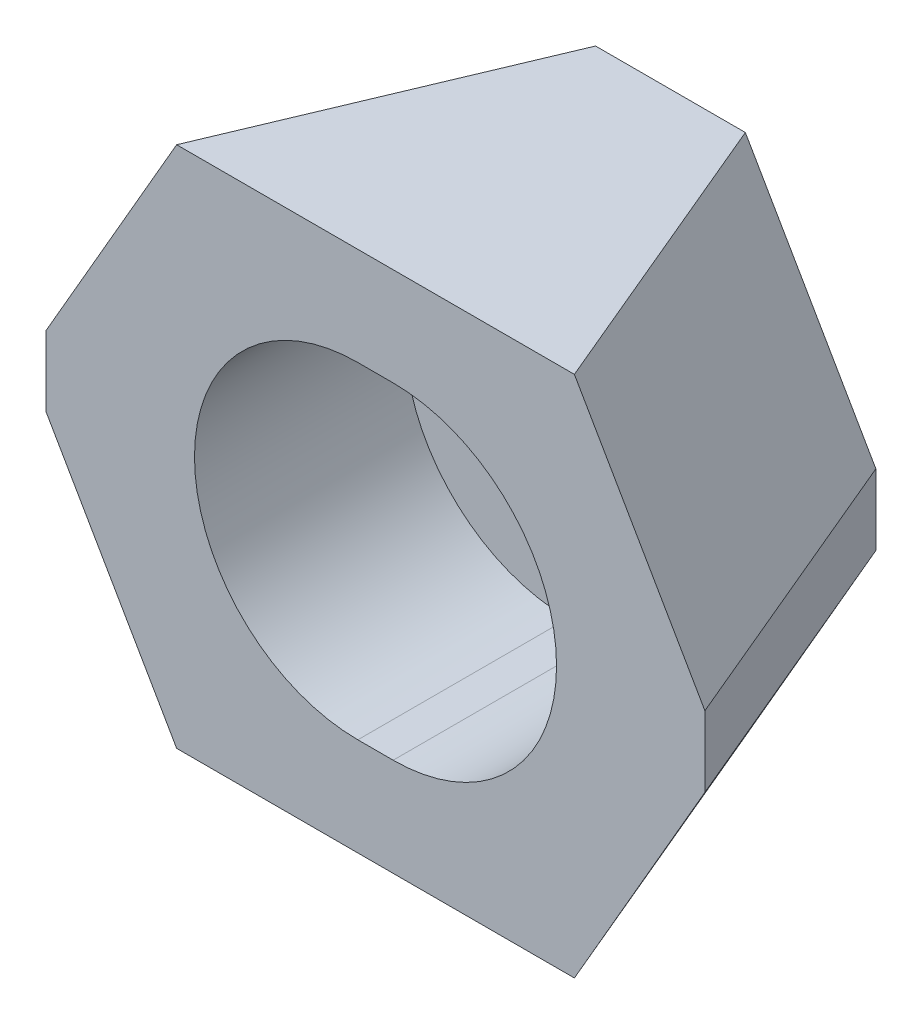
ISO-10303-21;
HEADER;
FILE_DESCRIPTION(('STEP AP214'),'2;1');
FILE_NAME('part.step','',(''),(''),'','','');
FILE_SCHEMA(('AUTOMOTIVE_DESIGN { 1 0 10303 214 1 1 1 1 }'));
ENDSEC;
DATA;
#1=APPLICATION_CONTEXT('core data for automotive mechanical design processes');
#2=APPLICATION_PROTOCOL_DEFINITION('international standard','automotive_design',2000,#1);
#3=PRODUCT_CONTEXT('',#1,'mechanical');
#4=PRODUCT('Part','Part','',(#3));
#5=PRODUCT_RELATED_PRODUCT_CATEGORY('part','',(#4));
#6=PRODUCT_DEFINITION_FORMATION('','',#4);
#7=PRODUCT_DEFINITION_CONTEXT('part definition',#1,'design');
#8=PRODUCT_DEFINITION('design','',#6,#7);
#9=PRODUCT_DEFINITION_SHAPE('','',#8);
#10=(LENGTH_UNIT() NAMED_UNIT(*) SI_UNIT(.MILLI.,.METRE.));
#11=(NAMED_UNIT(*) PLANE_ANGLE_UNIT() SI_UNIT($,.RADIAN.));
#12=(NAMED_UNIT(*) SI_UNIT($,.STERADIAN.) SOLID_ANGLE_UNIT());
#13=UNCERTAINTY_MEASURE_WITH_UNIT(LENGTH_MEASURE(1.E-05),#10,'distance_accuracy_value','');
#14=(GEOMETRIC_REPRESENTATION_CONTEXT(3) GLOBAL_UNCERTAINTY_ASSIGNED_CONTEXT((#13)) GLOBAL_UNIT_ASSIGNED_CONTEXT((#10,
#11,#12)) REPRESENTATION_CONTEXT('',''));
#15=CARTESIAN_POINT('',(0.,0.,0.));
#16=DIRECTION('',(0.,0.,1.));
#17=DIRECTION('',(1.,0.,0.));
#18=AXIS2_PLACEMENT_3D('',#15,#16,#17);
#19=CARTESIAN_POINT('',(1.,0.,16.7));
#20=DIRECTION('',(0.,0.,-1.));
#21=DIRECTION('',(-1.,0.,0.));
#22=AXIS2_PLACEMENT_3D('',#19,#20,#21);
#23=CYLINDRICAL_SURFACE('',#22,6.15);
#24=DIRECTION('',(0.,0.,1.));
#25=VECTOR('',#24,1.);
#26=CARTESIAN_POINT('',(1.,6.15,16.7));
#27=LINE('',#26,#25);
#28=CARTESIAN_POINT('',(1.,6.15,4.8));
#29=VERTEX_POINT('',#28);
#30=CARTESIAN_POINT('',(1.,6.15,0.));
#31=VERTEX_POINT('',#30);
#32=EDGE_CURVE('E215',#29,#31,#27,.F.);
#33=ORIENTED_EDGE('',*,*,#32,.T.);
#34=CARTESIAN_POINT('',(1.,0.,0.));
#35=DIRECTION('',(0.,0.,-1.));
#36=DIRECTION('',(-1.,0.,0.));
#37=AXIS2_PLACEMENT_3D('',#34,#35,#36);
#38=CIRCLE('',#37,6.15);
#39=CARTESIAN_POINT('',(1.,-6.15,0.));
#40=VERTEX_POINT('',#39);
#41=EDGE_CURVE('E139',#31,#40,#38,.T.);
#42=ORIENTED_EDGE('',*,*,#41,.T.);
#43=DIRECTION('',(0.,0.,-1.));
#44=VECTOR('',#43,1.);
#45=CARTESIAN_POINT('',(1.,-6.15,16.7));
#46=LINE('',#45,#44);
#47=CARTESIAN_POINT('',(1.,-6.15,4.8));
#48=VERTEX_POINT('',#47);
#49=EDGE_CURVE('E219',#40,#48,#46,.F.);
#50=ORIENTED_EDGE('',*,*,#49,.T.);
#51=CARTESIAN_POINT('',(1.,0.,4.8));
#52=DIRECTION('',(0.,0.,-1.));
#53=DIRECTION('',(-1.,0.,0.));
#54=AXIS2_PLACEMENT_3D('',#51,#52,#53);
#55=CIRCLE('',#54,6.15);
#56=EDGE_CURVE('E142',#29,#48,#55,.T.);
#57=ORIENTED_EDGE('',*,*,#56,.F.);
#58=EDGE_LOOP('',(#33,#42,#50,#57));
#59=FACE_BOUND('',#58,.T.);
#60=ADVANCED_FACE('F14',(#59),#23,.F.);
#61=CARTESIAN_POINT('',(-1.,-6.15,16.7));
#62=DIRECTION('',(0.,-1.,0.));
#63=DIRECTION('',(0.,0.,-1.));
#64=AXIS2_PLACEMENT_3D('',#61,#62,#63);
#65=PLANE('',#64);
#66=ORIENTED_EDGE('',*,*,#49,.F.);
#67=DIRECTION('',(1.,0.,0.));
#68=VECTOR('',#67,1.);
#69=CARTESIAN_POINT('',(0.,-6.15,0.));
#70=LINE('',#69,#68);
#71=CARTESIAN_POINT('',(-1.,-6.15,0.));
#72=VERTEX_POINT('',#71);
#73=EDGE_CURVE('E138',#40,#72,#70,.F.);
#74=ORIENTED_EDGE('',*,*,#73,.T.);
#75=DIRECTION('',(0.,0.,-1.));
#76=VECTOR('',#75,1.);
#77=CARTESIAN_POINT('',(-1.,-6.15,16.7));
#78=LINE('',#77,#76);
#79=CARTESIAN_POINT('',(-1.,-6.15,4.8));
#80=VERTEX_POINT('',#79);
#81=EDGE_CURVE('E217',#72,#80,#78,.F.);
#82=ORIENTED_EDGE('',*,*,#81,.T.);
#83=DIRECTION('',(1.,0.,0.));
#84=VECTOR('',#83,1.);
#85=CARTESIAN_POINT('',(0.,-6.15,4.8));
#86=LINE('',#85,#84);
#87=EDGE_CURVE('E141',#48,#80,#86,.F.);
#88=ORIENTED_EDGE('',*,*,#87,.F.);
#89=EDGE_LOOP('',(#66,#74,#82,#88));
#90=FACE_BOUND('',#89,.T.);
#91=ADVANCED_FACE('F455',(#90),#65,.F.);
#92=CARTESIAN_POINT('',(-1.,0.,16.7));
#93=DIRECTION('',(0.,0.,-1.));
#94=DIRECTION('',(-1.,0.,0.));
#95=AXIS2_PLACEMENT_3D('',#92,#93,#94);
#96=CYLINDRICAL_SURFACE('',#95,6.15);
#97=ORIENTED_EDGE('',*,*,#81,.F.);
#98=CARTESIAN_POINT('',(-1.,0.,0.));
#99=DIRECTION('',(0.,0.,-1.));
#100=DIRECTION('',(-1.,0.,0.));
#101=AXIS2_PLACEMENT_3D('',#98,#99,#100);
#102=CIRCLE('',#101,6.15);
#103=CARTESIAN_POINT('',(-1.,6.15,0.));
#104=VERTEX_POINT('',#103);
#105=EDGE_CURVE('E135',#72,#104,#102,.T.);
#106=ORIENTED_EDGE('',*,*,#105,.T.);
#107=DIRECTION('',(0.,0.,1.));
#108=VECTOR('',#107,1.);
#109=CARTESIAN_POINT('',(-1.,6.15,16.7));
#110=LINE('',#109,#108);
#111=CARTESIAN_POINT('',(-1.,6.15,4.8));
#112=VERTEX_POINT('',#111);
#113=EDGE_CURVE('E149',#104,#112,#110,.T.);
#114=ORIENTED_EDGE('',*,*,#113,.T.);
#115=CARTESIAN_POINT('',(-1.,0.,4.8));
#116=DIRECTION('',(0.,0.,-1.));
#117=DIRECTION('',(-1.,0.,0.));
#118=AXIS2_PLACEMENT_3D('',#115,#116,#117);
#119=CIRCLE('',#118,6.15);
#120=EDGE_CURVE('E146',#80,#112,#119,.T.);
#121=ORIENTED_EDGE('',*,*,#120,.F.);
#122=EDGE_LOOP('',(#97,#106,#114,#121));
#123=FACE_BOUND('',#122,.T.);
#124=ADVANCED_FACE('F447',(#123),#96,.F.);
#125=CARTESIAN_POINT('',(1.,6.15,16.7));
#126=DIRECTION('',(0.,1.,0.));
#127=DIRECTION('',(0.,0.,1.));
#128=AXIS2_PLACEMENT_3D('',#125,#126,#127);
#129=PLANE('',#128);
#130=ORIENTED_EDGE('',*,*,#113,.F.);
#131=DIRECTION('',(1.,0.,0.));
#132=VECTOR('',#131,1.);
#133=CARTESIAN_POINT('',(0.,6.15,0.));
#134=LINE('',#133,#132);
#135=EDGE_CURVE('E137',#104,#31,#134,.T.);
#136=ORIENTED_EDGE('',*,*,#135,.T.);
#137=ORIENTED_EDGE('',*,*,#32,.F.);
#138=DIRECTION('',(1.,0.,0.));
#139=VECTOR('',#138,1.);
#140=CARTESIAN_POINT('',(0.,6.15,4.8));
#141=LINE('',#140,#139);
#142=EDGE_CURVE('E145',#112,#29,#141,.T.);
#143=ORIENTED_EDGE('',*,*,#142,.F.);
#144=EDGE_LOOP('',(#130,#136,#137,#143));
#145=FACE_BOUND('',#144,.T.);
#146=ADVANCED_FACE('F328',(#145),#129,.F.);
#147=CARTESIAN_POINT('',(0.,0.,4.8));
#148=DIRECTION('',(0.,0.,1.));
#149=DIRECTION('',(1.,0.,0.));
#150=AXIS2_PLACEMENT_3D('',#147,#148,#149);
#151=PLANE('',#150);
#152=ORIENTED_EDGE('',*,*,#56,.T.);
#153=ORIENTED_EDGE('',*,*,#87,.T.);
#154=ORIENTED_EDGE('',*,*,#120,.T.);
#155=ORIENTED_EDGE('',*,*,#142,.T.);
#156=EDGE_LOOP('',(#152,#153,#154,#155));
#157=FACE_BOUND('',#156,.T.);
#158=CARTESIAN_POINT('',(-1.,0.,4.8));
#159=DIRECTION('',(0.,0.,1.));
#160=DIRECTION('',(1.,0.,0.));
#161=AXIS2_PLACEMENT_3D('',#158,#159,#160);
#162=CIRCLE('',#161,9.25);
#163=CARTESIAN_POINT('',(-1.,-9.25,4.8));
#164=VERTEX_POINT('',#163);
#165=CARTESIAN_POINT('',(-1.,9.25,4.8));
#166=VERTEX_POINT('',#165);
#167=EDGE_CURVE('E150',#164,#166,#162,.F.);
#168=ORIENTED_EDGE('',*,*,#167,.F.);
#169=DIRECTION('',(1.,0.,0.));
#170=VECTOR('',#169,1.);
#171=CARTESIAN_POINT('',(0.,-9.25,4.8));
#172=LINE('',#171,#170);
#173=CARTESIAN_POINT('',(1.,-9.25,4.8));
#174=VERTEX_POINT('',#173);
#175=EDGE_CURVE('E112',#164,#174,#172,.T.);
#176=ORIENTED_EDGE('',*,*,#175,.T.);
#177=CARTESIAN_POINT('',(1.,0.,4.8));
#178=DIRECTION('',(0.,0.,1.));
#179=DIRECTION('',(1.,0.,0.));
#180=AXIS2_PLACEMENT_3D('',#177,#178,#179);
#181=CIRCLE('',#180,9.25);
#182=CARTESIAN_POINT('',(1.,9.25,4.8));
#183=VERTEX_POINT('',#182);
#184=EDGE_CURVE('E107',#174,#183,#181,.T.);
#185=ORIENTED_EDGE('',*,*,#184,.T.);
#186=DIRECTION('',(-1.,0.,0.));
#187=VECTOR('',#186,1.);
#188=CARTESIAN_POINT('',(0.,9.25,4.8));
#189=LINE('',#188,#187);
#190=EDGE_CURVE('E18',#183,#166,#189,.T.);
#191=ORIENTED_EDGE('',*,*,#190,.T.);
#192=EDGE_LOOP('',(#168,#176,#185,#191));
#193=FACE_BOUND('',#192,.T.);
#194=ADVANCED_FACE('F109',(#157,#193),#151,.T.);
#195=CARTESIAN_POINT('',(0.,0.,0.));
#196=DIRECTION('',(0.,0.,1.));
#197=DIRECTION('',(1.,0.,0.));
#198=AXIS2_PLACEMENT_3D('',#195,#196,#197);
#199=PLANE('',#198);
#200=ORIENTED_EDGE('',*,*,#105,.F.);
#201=ORIENTED_EDGE('',*,*,#73,.F.);
#202=ORIENTED_EDGE('',*,*,#41,.F.);
#203=ORIENTED_EDGE('',*,*,#135,.F.);
#204=EDGE_LOOP('',(#200,#201,#202,#203));
#205=FACE_BOUND('',#204,.T.);
#206=DIRECTION('',(0.,1.,0.));
#207=VECTOR('',#206,1.);
#208=CARTESIAN_POINT('',(11.6299664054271,7.4,0.));
#209=LINE('',#208,#207);
#210=CARTESIAN_POINT('',(11.6299664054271,-2.00244903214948,0.));
#211=VERTEX_POINT('',#210);
#212=CARTESIAN_POINT('',(11.6299664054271,2.0024490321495,0.));
#213=VERTEX_POINT('',#212);
#214=EDGE_CURVE('E115',#211,#213,#209,.T.);
#215=ORIENTED_EDGE('',*,*,#214,.F.);
#216=DIRECTION('',(0.5,0.866025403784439,0.));
#217=VECTOR('',#216,1.);
#218=CARTESIAN_POINT('',(11.4877979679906,-2.24869198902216,0.));
#219=LINE('',#218,#217);
#220=CARTESIAN_POINT('',(4.24129690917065,-14.8,0.));
#221=VERTEX_POINT('',#220);
#222=EDGE_CURVE('E164',#221,#211,#219,.T.);
#223=ORIENTED_EDGE('',*,*,#222,.F.);
#224=DIRECTION('',(1.,0.,0.));
#225=VECTOR('',#224,1.);
#226=CARTESIAN_POINT('',(18.65,-14.8,0.));
#227=LINE('',#226,#225);
#228=CARTESIAN_POINT('',(-4.24129690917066,-14.8,0.));
#229=VERTEX_POINT('',#228);
#230=EDGE_CURVE('E181',#229,#221,#227,.T.);
#231=ORIENTED_EDGE('',*,*,#230,.F.);
#232=DIRECTION('',(0.5,-0.866025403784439,0.));
#233=VECTOR('',#232,1.);
#234=CARTESIAN_POINT('',(-7.792756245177,-8.64869198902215,0.));
#235=LINE('',#234,#233);
#236=CARTESIAN_POINT('',(-11.6299664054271,-2.00244903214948,0.));
#237=VERTEX_POINT('',#236);
#238=EDGE_CURVE('E187',#237,#229,#235,.T.);
#239=ORIENTED_EDGE('',*,*,#238,.F.);
#240=DIRECTION('',(0.,1.,0.));
#241=VECTOR('',#240,1.);
#242=CARTESIAN_POINT('',(-11.6299664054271,-7.4,0.));
#243=LINE('',#242,#241);
#244=CARTESIAN_POINT('',(-11.6299664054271,2.0024490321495,0.));
#245=VERTEX_POINT('',#244);
#246=EDGE_CURVE('E193',#245,#237,#243,.F.);
#247=ORIENTED_EDGE('',*,*,#246,.F.);
#248=DIRECTION('',(-0.5,-0.866025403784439,0.));
#249=VECTOR('',#248,1.);
#250=CARTESIAN_POINT('',(-11.4877979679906,2.24869198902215,0.));
#251=LINE('',#250,#249);
#252=CARTESIAN_POINT('',(-4.24129690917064,14.8,0.));
#253=VERTEX_POINT('',#252);
#254=EDGE_CURVE('E199',#253,#245,#251,.T.);
#255=ORIENTED_EDGE('',*,*,#254,.F.);
#256=DIRECTION('',(1.,0.,0.));
#257=VECTOR('',#256,1.);
#258=CARTESIAN_POINT('',(-18.65,14.8,0.));
#259=LINE('',#258,#257);
#260=CARTESIAN_POINT('',(4.24129690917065,14.8,0.));
#261=VERTEX_POINT('',#260);
#262=EDGE_CURVE('E205',#261,#253,#259,.F.);
#263=ORIENTED_EDGE('',*,*,#262,.F.);
#264=DIRECTION('',(-0.5,0.866025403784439,0.));
#265=VECTOR('',#264,1.);
#266=CARTESIAN_POINT('',(7.792756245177,8.64869198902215,0.));
#267=LINE('',#266,#265);
#268=EDGE_CURVE('E152',#213,#261,#267,.T.);
#269=ORIENTED_EDGE('',*,*,#268,.F.);
#270=EDGE_LOOP('',(#215,#223,#231,#239,#247,#255,#263,#269));
#271=FACE_BOUND('',#270,.T.);
#272=ADVANCED_FACE('F311',(#205,#271),#199,.F.);
#273=CARTESIAN_POINT('',(10.4247386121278,10.1682677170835,8.35));
#274=DIRECTION('',(0.813797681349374,0.469846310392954,-0.342020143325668));
#275=DIRECTION('',(-0.5,0.866025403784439,0.));
#276=AXIS2_PLACEMENT_3D('',#273,#274,#275);
#277=PLANE('',#276);
#278=DIRECTION('',(-0.387449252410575,0.,-0.921891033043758));
#279=VECTOR('',#278,1.);
#280=CARTESIAN_POINT('',(11.2599165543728,14.8,16.7));
#281=LINE('',#280,#279);
#282=CARTESIAN_POINT('',(11.2599165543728,14.8,16.7));
#283=VERTEX_POINT('',#282);
#284=EDGE_CURVE('E178',#283,#261,#281,.T.);
#285=ORIENTED_EDGE('',*,*,#284,.F.);
#286=DIRECTION('',(-0.5,0.866025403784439,0.));
#287=VECTOR('',#286,1.);
#288=CARTESIAN_POINT('',(18.65,2.,16.7));
#289=LINE('',#288,#287);
#290=CARTESIAN_POINT('',(18.65,2.,16.7));
#291=VERTEX_POINT('',#290);
#292=EDGE_CURVE('E124',#291,#283,#289,.T.);
#293=ORIENTED_EDGE('',*,*,#292,.F.);
#294=DIRECTION('',(0.387515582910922,-0.0001351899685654,0.921863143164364));
#295=VECTOR('',#294,1.);
#296=CARTESIAN_POINT('',(11.6299664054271,2.0024490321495,0.));
#297=LINE('',#296,#295);
#298=EDGE_CURVE('E167',#213,#291,#297,.T.);
#299=ORIENTED_EDGE('',*,*,#298,.F.);
#300=ORIENTED_EDGE('',*,*,#268,.T.);
#301=EDGE_LOOP('',(#285,#293,#299,#300));
#302=FACE_BOUND('',#301,.T.);
#303=ADVANCED_FACE('F308',(#302),#277,.T.);
#304=CARTESIAN_POINT('',(-18.65,14.8,0.));
#305=DIRECTION('',(0.,1.,0.));
#306=DIRECTION('',(0.,0.,1.));
#307=AXIS2_PLACEMENT_3D('',#304,#305,#306);
#308=PLANE('',#307);
#309=DIRECTION('',(0.387449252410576,0.,-0.921891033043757));
#310=VECTOR('',#309,1.);
#311=CARTESIAN_POINT('',(-11.2599165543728,14.8,16.7));
#312=LINE('',#311,#310);
#313=CARTESIAN_POINT('',(-11.2599165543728,14.8,16.7));
#314=VERTEX_POINT('',#313);
#315=EDGE_CURVE('E202',#314,#253,#312,.T.);
#316=ORIENTED_EDGE('',*,*,#315,.F.);
#317=DIRECTION('',(1.,0.,0.));
#318=VECTOR('',#317,1.);
#319=CARTESIAN_POINT('',(0.,14.8,16.7));
#320=LINE('',#319,#318);
#321=EDGE_CURVE('E126',#283,#314,#320,.F.);
#322=ORIENTED_EDGE('',*,*,#321,.F.);
#323=ORIENTED_EDGE('',*,*,#284,.T.);
#324=ORIENTED_EDGE('',*,*,#262,.T.);
#325=EDGE_LOOP('',(#316,#322,#323,#324));
#326=FACE_BOUND('',#325,.T.);
#327=ADVANCED_FACE('F306',(#326),#308,.T.);
#328=CARTESIAN_POINT('',(-14.1197803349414,3.76826771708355,8.35));
#329=DIRECTION('',(-0.813797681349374,0.469846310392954,-0.342020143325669));
#330=DIRECTION('',(-0.5,-0.866025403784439,0.));
#331=AXIS2_PLACEMENT_3D('',#328,#329,#330);
#332=PLANE('',#331);
#333=DIRECTION('',(0.387515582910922,0.000135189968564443,-0.921863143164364));
#334=VECTOR('',#333,1.);
#335=CARTESIAN_POINT('',(-18.65,2.,16.7));
#336=LINE('',#335,#334);
#337=CARTESIAN_POINT('',(-18.65,2.,16.7));
#338=VERTEX_POINT('',#337);
#339=EDGE_CURVE('E196',#338,#245,#336,.T.);
#340=ORIENTED_EDGE('',*,*,#339,.F.);
#341=DIRECTION('',(-0.5,-0.866025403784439,0.));
#342=VECTOR('',#341,1.);
#343=CARTESIAN_POINT('',(-11.2599165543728,14.8,16.7));
#344=LINE('',#343,#342);
#345=EDGE_CURVE('E131',#314,#338,#344,.T.);
#346=ORIENTED_EDGE('',*,*,#345,.F.);
#347=ORIENTED_EDGE('',*,*,#315,.T.);
#348=ORIENTED_EDGE('',*,*,#254,.T.);
#349=EDGE_LOOP('',(#340,#346,#347,#348));
#350=FACE_BOUND('',#349,.T.);
#351=ADVANCED_FACE('F247',(#350),#332,.T.);
#352=CARTESIAN_POINT('',(-15.1399832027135,-7.4,8.35));
#353=DIRECTION('',(-0.921863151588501,0.,-0.387515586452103));
#354=DIRECTION('',(-0.387515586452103,0.,0.921863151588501));
#355=AXIS2_PLACEMENT_3D('',#352,#353,#354);
#356=PLANE('',#355);
#357=ORIENTED_EDGE('',*,*,#339,.T.);
#358=ORIENTED_EDGE('',*,*,#246,.T.);
#359=DIRECTION('',(0.387515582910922,-0.000135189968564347,-0.921863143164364));
#360=VECTOR('',#359,1.);
#361=CARTESIAN_POINT('',(-18.65,-2.,16.7));
#362=LINE('',#361,#360);
#363=CARTESIAN_POINT('',(-18.65,-2.,16.7));
#364=VERTEX_POINT('',#363);
#365=EDGE_CURVE('E190',#364,#237,#362,.T.);
#366=ORIENTED_EDGE('',*,*,#365,.F.);
#367=DIRECTION('',(0.,1.,0.));
#368=VECTOR('',#367,1.);
#369=CARTESIAN_POINT('',(-18.65,0.,16.7));
#370=LINE('',#369,#368);
#371=EDGE_CURVE('E238',#338,#364,#370,.F.);
#372=ORIENTED_EDGE('',*,*,#371,.F.);
#373=EDGE_LOOP('',(#357,#358,#366,#372));
#374=FACE_BOUND('',#373,.T.);
#375=ADVANCED_FACE('F255',(#374),#356,.T.);
#376=CARTESIAN_POINT('',(-10.4247386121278,-10.1682677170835,8.35));
#377=DIRECTION('',(-0.813797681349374,-0.469846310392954,-0.342020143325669));
#378=DIRECTION('',(0.5,-0.866025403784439,0.));
#379=AXIS2_PLACEMENT_3D('',#376,#377,#378);
#380=PLANE('',#379);
#381=DIRECTION('',(0.387449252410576,0.,-0.921891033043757));
#382=VECTOR('',#381,1.);
#383=CARTESIAN_POINT('',(-11.2599165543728,-14.8,16.7));
#384=LINE('',#383,#382);
#385=CARTESIAN_POINT('',(-11.2599165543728,-14.8,16.7));
#386=VERTEX_POINT('',#385);
#387=EDGE_CURVE('E184',#386,#229,#384,.T.);
#388=ORIENTED_EDGE('',*,*,#387,.F.);
#389=DIRECTION('',(0.5,-0.866025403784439,0.));
#390=VECTOR('',#389,1.);
#391=CARTESIAN_POINT('',(-18.65,-2.,16.7));
#392=LINE('',#391,#390);
#393=EDGE_CURVE('E235',#364,#386,#392,.T.);
#394=ORIENTED_EDGE('',*,*,#393,.F.);
#395=ORIENTED_EDGE('',*,*,#365,.T.);
#396=ORIENTED_EDGE('',*,*,#238,.T.);
#397=EDGE_LOOP('',(#388,#394,#395,#396));
#398=FACE_BOUND('',#397,.T.);
#399=ADVANCED_FACE('F262',(#398),#380,.T.);
#400=CARTESIAN_POINT('',(18.65,-14.8,0.));
#401=DIRECTION('',(0.,-1.,0.));
#402=DIRECTION('',(0.,0.,-1.));
#403=AXIS2_PLACEMENT_3D('',#400,#401,#402);
#404=PLANE('',#403);
#405=ORIENTED_EDGE('',*,*,#387,.T.);
#406=ORIENTED_EDGE('',*,*,#230,.T.);
#407=DIRECTION('',(-0.387449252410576,0.,-0.921891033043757));
#408=VECTOR('',#407,1.);
#409=CARTESIAN_POINT('',(11.2599165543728,-14.8,16.7));
#410=LINE('',#409,#408);
#411=CARTESIAN_POINT('',(11.2599165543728,-14.8,16.7));
#412=VERTEX_POINT('',#411);
#413=EDGE_CURVE('E168',#412,#221,#410,.T.);
#414=ORIENTED_EDGE('',*,*,#413,.F.);
#415=DIRECTION('',(1.,0.,0.));
#416=VECTOR('',#415,1.);
#417=CARTESIAN_POINT('',(0.,-14.8,16.7));
#418=LINE('',#417,#416);
#419=EDGE_CURVE('E232',#386,#412,#418,.T.);
#420=ORIENTED_EDGE('',*,*,#419,.F.);
#421=EDGE_LOOP('',(#405,#406,#414,#420));
#422=FACE_BOUND('',#421,.T.);
#423=ADVANCED_FACE('F267',(#422),#404,.T.);
#424=CARTESIAN_POINT('',(14.1197803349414,-3.76826771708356,8.35));
#425=DIRECTION('',(0.813797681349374,-0.469846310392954,-0.342020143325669));
#426=DIRECTION('',(0.5,0.866025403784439,0.));
#427=AXIS2_PLACEMENT_3D('',#424,#425,#426);
#428=PLANE('',#427);
#429=DIRECTION('',(-0.387515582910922,-0.000135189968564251,-0.921863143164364));
#430=VECTOR('',#429,1.);
#431=CARTESIAN_POINT('',(18.65,-2.,16.7));
#432=LINE('',#431,#430);
#433=CARTESIAN_POINT('',(18.65,-2.,16.7));
#434=VERTEX_POINT('',#433);
#435=EDGE_CURVE('E173',#434,#211,#432,.T.);
#436=ORIENTED_EDGE('',*,*,#435,.F.);
#437=DIRECTION('',(0.5,0.866025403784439,0.));
#438=VECTOR('',#437,1.);
#439=CARTESIAN_POINT('',(11.2599165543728,-14.8,16.7));
#440=LINE('',#439,#438);
#441=EDGE_CURVE('E229',#412,#434,#440,.T.);
#442=ORIENTED_EDGE('',*,*,#441,.F.);
#443=ORIENTED_EDGE('',*,*,#413,.T.);
#444=ORIENTED_EDGE('',*,*,#222,.T.);
#445=EDGE_LOOP('',(#436,#442,#443,#444));
#446=FACE_BOUND('',#445,.T.);
#447=ADVANCED_FACE('F275',(#446),#428,.T.);
#448=CARTESIAN_POINT('',(15.1399832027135,7.4,8.35));
#449=DIRECTION('',(0.921863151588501,0.,-0.387515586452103));
#450=DIRECTION('',(-0.387515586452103,0.,-0.921863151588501));
#451=AXIS2_PLACEMENT_3D('',#448,#449,#450);
#452=PLANE('',#451);
#453=ORIENTED_EDGE('',*,*,#435,.T.);
#454=ORIENTED_EDGE('',*,*,#214,.T.);
#455=ORIENTED_EDGE('',*,*,#298,.T.);
#456=DIRECTION('',(0.,1.,0.));
#457=VECTOR('',#456,1.);
#458=CARTESIAN_POINT('',(18.65,0.,16.7));
#459=LINE('',#458,#457);
#460=EDGE_CURVE('E227',#434,#291,#459,.T.);
#461=ORIENTED_EDGE('',*,*,#460,.F.);
#462=EDGE_LOOP('',(#453,#454,#455,#461));
#463=FACE_BOUND('',#462,.T.);
#464=ADVANCED_FACE('F282',(#463),#452,.T.);
#465=CARTESIAN_POINT('',(1.,0.,16.7));
#466=DIRECTION('',(0.,0.,-1.));
#467=DIRECTION('',(-1.,0.,0.));
#468=AXIS2_PLACEMENT_3D('',#465,#466,#467);
#469=CYLINDRICAL_SURFACE('',#468,9.25);
#470=DIRECTION('',(0.,0.,-1.));
#471=VECTOR('',#470,1.);
#472=CARTESIAN_POINT('',(1.,-9.25,16.7));
#473=LINE('',#472,#471);
#474=CARTESIAN_POINT('',(1.,-9.25,16.7));
#475=VERTEX_POINT('',#474);
#476=EDGE_CURVE('E114',#174,#475,#473,.F.);
#477=ORIENTED_EDGE('',*,*,#476,.T.);
#478=CARTESIAN_POINT('',(1.,0.,16.7));
#479=DIRECTION('',(0.,0.,-1.));
#480=DIRECTION('',(-1.,0.,0.));
#481=AXIS2_PLACEMENT_3D('',#478,#479,#480);
#482=CIRCLE('',#481,9.25);
#483=CARTESIAN_POINT('',(1.,9.25,16.7));
#484=VERTEX_POINT('',#483);
#485=EDGE_CURVE('E120',#484,#475,#482,.T.);
#486=ORIENTED_EDGE('',*,*,#485,.F.);
#487=DIRECTION('',(0.,0.,1.));
#488=VECTOR('',#487,1.);
#489=CARTESIAN_POINT('',(1.,9.25,16.7));
#490=LINE('',#489,#488);
#491=EDGE_CURVE('E117',#484,#183,#490,.F.);
#492=ORIENTED_EDGE('',*,*,#491,.T.);
#493=ORIENTED_EDGE('',*,*,#184,.F.);
#494=EDGE_LOOP('',(#477,#486,#492,#493));
#495=FACE_BOUND('',#494,.T.);
#496=ADVANCED_FACE('F118',(#495),#469,.F.);
#497=CARTESIAN_POINT('',(-1.,-9.25,16.7));
#498=DIRECTION('',(0.,-1.,0.));
#499=DIRECTION('',(0.,0.,-1.));
#500=AXIS2_PLACEMENT_3D('',#497,#498,#499);
#501=PLANE('',#500);
#502=DIRECTION('',(0.,0.,-1.));
#503=VECTOR('',#502,1.);
#504=CARTESIAN_POINT('',(-1.,-9.25,16.7));
#505=LINE('',#504,#503);
#506=CARTESIAN_POINT('',(-1.,-9.25,16.7));
#507=VERTEX_POINT('',#506);
#508=EDGE_CURVE('E497',#164,#507,#505,.F.);
#509=ORIENTED_EDGE('',*,*,#508,.T.);
#510=DIRECTION('',(1.,0.,0.));
#511=VECTOR('',#510,1.);
#512=CARTESIAN_POINT('',(0.,-9.25,16.7));
#513=LINE('',#512,#511);
#514=EDGE_CURVE('E223',#475,#507,#513,.F.);
#515=ORIENTED_EDGE('',*,*,#514,.F.);
#516=ORIENTED_EDGE('',*,*,#476,.F.);
#517=ORIENTED_EDGE('',*,*,#175,.F.);
#518=EDGE_LOOP('',(#509,#515,#516,#517));
#519=FACE_BOUND('',#518,.T.);
#520=ADVANCED_FACE('F16',(#519),#501,.F.);
#521=CARTESIAN_POINT('',(-1.,0.,16.7));
#522=DIRECTION('',(0.,0.,-1.));
#523=DIRECTION('',(-1.,0.,0.));
#524=AXIS2_PLACEMENT_3D('',#521,#522,#523);
#525=CYLINDRICAL_SURFACE('',#524,9.25);
#526=DIRECTION('',(0.,0.,1.));
#527=VECTOR('',#526,1.);
#528=CARTESIAN_POINT('',(-1.,9.25,16.7));
#529=LINE('',#528,#527);
#530=CARTESIAN_POINT('',(-1.,9.25,16.7));
#531=VERTEX_POINT('',#530);
#532=EDGE_CURVE('E33',#166,#531,#529,.T.);
#533=ORIENTED_EDGE('',*,*,#532,.T.);
#534=CARTESIAN_POINT('',(-1.,0.,16.7));
#535=DIRECTION('',(0.,0.,-1.));
#536=DIRECTION('',(-1.,0.,0.));
#537=AXIS2_PLACEMENT_3D('',#534,#535,#536);
#538=CIRCLE('',#537,9.25);
#539=EDGE_CURVE('E24',#507,#531,#538,.T.);
#540=ORIENTED_EDGE('',*,*,#539,.F.);
#541=ORIENTED_EDGE('',*,*,#508,.F.);
#542=ORIENTED_EDGE('',*,*,#167,.T.);
#543=EDGE_LOOP('',(#533,#540,#541,#542));
#544=FACE_BOUND('',#543,.T.);
#545=ADVANCED_FACE('F340',(#544),#525,.F.);
#546=CARTESIAN_POINT('',(1.,9.25,16.7));
#547=DIRECTION('',(0.,1.,0.));
#548=DIRECTION('',(0.,0.,1.));
#549=AXIS2_PLACEMENT_3D('',#546,#547,#548);
#550=PLANE('',#549);
#551=ORIENTED_EDGE('',*,*,#491,.F.);
#552=DIRECTION('',(1.,0.,0.));
#553=VECTOR('',#552,1.);
#554=CARTESIAN_POINT('',(0.,9.25,16.7));
#555=LINE('',#554,#553);
#556=EDGE_CURVE('E9',#531,#484,#555,.T.);
#557=ORIENTED_EDGE('',*,*,#556,.F.);
#558=ORIENTED_EDGE('',*,*,#532,.F.);
#559=ORIENTED_EDGE('',*,*,#190,.F.);
#560=EDGE_LOOP('',(#551,#557,#558,#559));
#561=FACE_BOUND('',#560,.T.);
#562=ADVANCED_FACE('F123',(#561),#550,.F.);
#563=CARTESIAN_POINT('',(0.,0.,16.7));
#564=DIRECTION('',(0.,0.,1.));
#565=DIRECTION('',(1.,0.,0.));
#566=AXIS2_PLACEMENT_3D('',#563,#564,#565);
#567=PLANE('',#566);
#568=ORIENTED_EDGE('',*,*,#539,.T.);
#569=ORIENTED_EDGE('',*,*,#556,.T.);
#570=ORIENTED_EDGE('',*,*,#485,.T.);
#571=ORIENTED_EDGE('',*,*,#514,.T.);
#572=EDGE_LOOP('',(#568,#569,#570,#571));
#573=FACE_BOUND('',#572,.T.);
#574=ORIENTED_EDGE('',*,*,#441,.T.);
#575=ORIENTED_EDGE('',*,*,#460,.T.);
#576=ORIENTED_EDGE('',*,*,#292,.T.);
#577=ORIENTED_EDGE('',*,*,#321,.T.);
#578=ORIENTED_EDGE('',*,*,#345,.T.);
#579=ORIENTED_EDGE('',*,*,#371,.T.);
#580=ORIENTED_EDGE('',*,*,#393,.T.);
#581=ORIENTED_EDGE('',*,*,#419,.T.);
#582=EDGE_LOOP('',(#574,#575,#576,#577,#578,#579,#580,#581));
#583=FACE_BOUND('',#582,.T.);
#584=ADVANCED_FACE('F242',(#573,#583),#567,.T.);
#585=CLOSED_SHELL('',(#60,#91,#124,#146,#194,#272,#303,#327,#351,#375,#399,#423,#447,#464,#496,
#520,#545,#562,#584));
#586=MANIFOLD_SOLID_BREP('B1',#585);
#587=ADVANCED_BREP_SHAPE_REPRESENTATION('',(#18,#586),#14);
#588=SHAPE_DEFINITION_REPRESENTATION(#9,#587);
ENDSEC;
END-ISO-10303-21;
